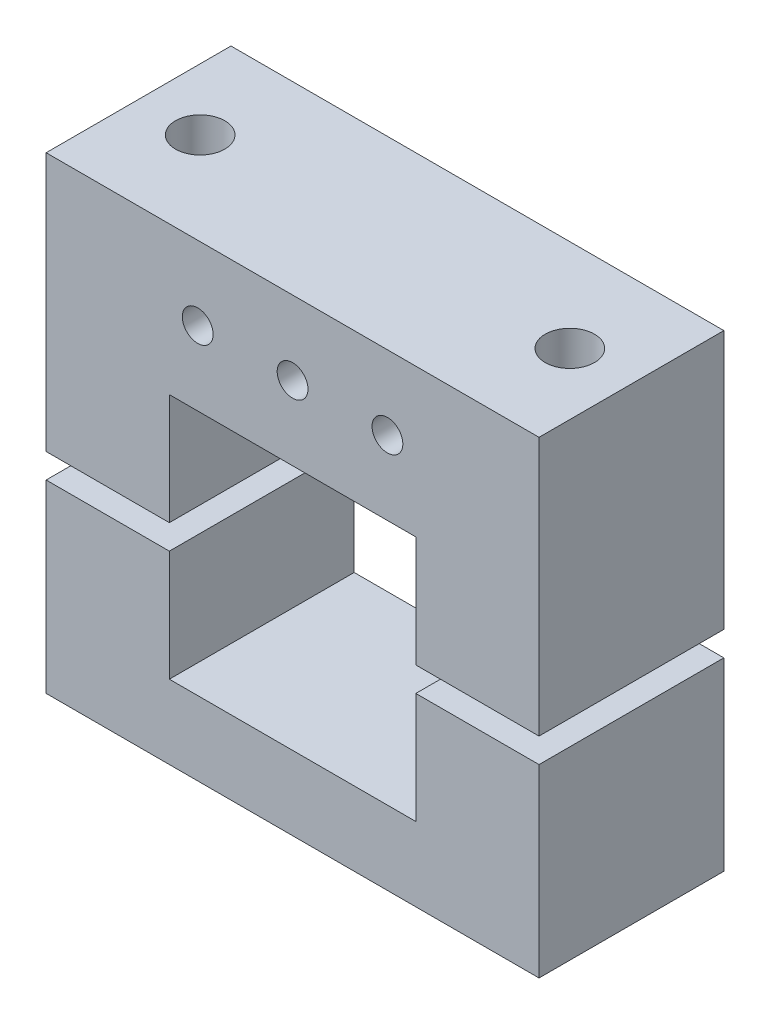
ISO-10303-21;
HEADER;
FILE_DESCRIPTION(('STEP AP214'),'2;1');
FILE_NAME('part.step','',(''),(''),'','','');
FILE_SCHEMA(('AUTOMOTIVE_DESIGN { 1 0 10303 214 1 1 1 1 }'));
ENDSEC;
DATA;
#1=APPLICATION_CONTEXT('core data for automotive mechanical design processes');
#2=APPLICATION_PROTOCOL_DEFINITION('international standard','automotive_design',2000,#1);
#3=PRODUCT_CONTEXT('',#1,'mechanical');
#4=PRODUCT('Part','Part','',(#3));
#5=PRODUCT_RELATED_PRODUCT_CATEGORY('part','',(#4));
#6=PRODUCT_DEFINITION_FORMATION('','',#4);
#7=PRODUCT_DEFINITION_CONTEXT('part definition',#1,'design');
#8=PRODUCT_DEFINITION('design','',#6,#7);
#9=PRODUCT_DEFINITION_SHAPE('','',#8);
#10=(LENGTH_UNIT() NAMED_UNIT(*) SI_UNIT(.MILLI.,.METRE.));
#11=(NAMED_UNIT(*) PLANE_ANGLE_UNIT() SI_UNIT($,.RADIAN.));
#12=(NAMED_UNIT(*) SI_UNIT($,.STERADIAN.) SOLID_ANGLE_UNIT());
#13=UNCERTAINTY_MEASURE_WITH_UNIT(LENGTH_MEASURE(1.E-05),#10,'distance_accuracy_value','');
#14=(GEOMETRIC_REPRESENTATION_CONTEXT(3) GLOBAL_UNCERTAINTY_ASSIGNED_CONTEXT((#13)) GLOBAL_UNIT_ASSIGNED_CONTEXT((#10,
#11,#12)) REPRESENTATION_CONTEXT('',''));
#15=CARTESIAN_POINT('',(0.,0.,0.));
#16=DIRECTION('',(0.,0.,1.));
#17=DIRECTION('',(1.,0.,0.));
#18=AXIS2_PLACEMENT_3D('',#15,#16,#17);
#19=CARTESIAN_POINT('',(-382.389529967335,0.294684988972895,15.));
#20=DIRECTION('',(1.,0.,0.));
#21=DIRECTION('',(0.,0.,-1.));
#22=AXIS2_PLACEMENT_3D('',#19,#20,#21);
#23=PLANE('',#22);
#24=DIRECTION('',(0.,-1.,0.));
#25=VECTOR('',#24,1.);
#26=CARTESIAN_POINT('',(-382.389529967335,0.294684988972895,0.));
#27=LINE('',#26,#25);
#28=CARTESIAN_POINT('',(-382.389529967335,0.294684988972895,0.));
#29=VERTEX_POINT('',#28);
#30=CARTESIAN_POINT('',(-382.389529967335,-8.70531501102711,0.));
#31=VERTEX_POINT('',#30);
#32=EDGE_CURVE('E140',#29,#31,#27,.T.);
#33=ORIENTED_EDGE('',*,*,#32,.T.);
#34=DIRECTION('',(0.,0.,-1.));
#35=VECTOR('',#34,1.);
#36=CARTESIAN_POINT('',(-382.389529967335,-8.70531501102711,15.));
#37=LINE('',#36,#35);
#38=CARTESIAN_POINT('',(-382.389529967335,-8.70531501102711,15.));
#39=VERTEX_POINT('',#38);
#40=EDGE_CURVE('E12',#39,#31,#37,.T.);
#41=ORIENTED_EDGE('',*,*,#40,.F.);
#42=DIRECTION('',(0.,-1.,0.));
#43=VECTOR('',#42,1.);
#44=CARTESIAN_POINT('',(-382.389529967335,0.294684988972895,15.));
#45=LINE('',#44,#43);
#46=CARTESIAN_POINT('',(-382.389529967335,0.294684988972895,15.));
#47=VERTEX_POINT('',#46);
#48=EDGE_CURVE('E155',#47,#39,#45,.T.);
#49=ORIENTED_EDGE('',*,*,#48,.F.);
#50=DIRECTION('',(0.,0.,-1.));
#51=VECTOR('',#50,1.);
#52=CARTESIAN_POINT('',(-382.389529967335,0.294684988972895,15.));
#53=LINE('',#52,#51);
#54=EDGE_CURVE('E136',#47,#29,#53,.T.);
#55=ORIENTED_EDGE('',*,*,#54,.T.);
#56=EDGE_LOOP('',(#33,#41,#49,#55));
#57=FACE_BOUND('',#56,.T.);
#58=ADVANCED_FACE('F42',(#57),#23,.F.);
#59=CARTESIAN_POINT('',(-382.389529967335,-8.70531501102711,15.));
#60=DIRECTION('',(0.,-1.,0.));
#61=DIRECTION('',(0.,0.,-1.));
#62=AXIS2_PLACEMENT_3D('',#59,#60,#61);
#63=PLANE('',#62);
#64=DIRECTION('',(-1.,0.,0.));
#65=VECTOR('',#64,1.);
#66=CARTESIAN_POINT('',(-382.389529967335,-8.70531501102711,0.));
#67=LINE('',#66,#65);
#68=CARTESIAN_POINT('',(-402.389529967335,-8.70531501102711,0.));
#69=VERTEX_POINT('',#68);
#70=EDGE_CURVE('E143',#31,#69,#67,.T.);
#71=ORIENTED_EDGE('',*,*,#70,.T.);
#72=DIRECTION('',(0.,0.,-1.));
#73=VECTOR('',#72,1.);
#74=CARTESIAN_POINT('',(-402.389529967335,-8.70531501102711,15.));
#75=LINE('',#74,#73);
#76=CARTESIAN_POINT('',(-402.389529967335,-8.70531501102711,15.));
#77=VERTEX_POINT('',#76);
#78=EDGE_CURVE('E51',#77,#69,#75,.T.);
#79=ORIENTED_EDGE('',*,*,#78,.F.);
#80=DIRECTION('',(-1.,0.,0.));
#81=VECTOR('',#80,1.);
#82=CARTESIAN_POINT('',(-382.389529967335,-8.70531501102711,15.));
#83=LINE('',#82,#81);
#84=EDGE_CURVE('E103',#39,#77,#83,.T.);
#85=ORIENTED_EDGE('',*,*,#84,.F.);
#86=ORIENTED_EDGE('',*,*,#40,.T.);
#87=EDGE_LOOP('',(#71,#79,#85,#86));
#88=FACE_BOUND('',#87,.T.);
#89=ADVANCED_FACE('F212',(#88),#63,.F.);
#90=CARTESIAN_POINT('',(-402.389529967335,0.294684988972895,15.));
#91=DIRECTION('',(-1.,0.,0.));
#92=DIRECTION('',(0.,0.,1.));
#93=AXIS2_PLACEMENT_3D('',#90,#91,#92);
#94=PLANE('',#93);
#95=DIRECTION('',(0.,1.,0.));
#96=VECTOR('',#95,1.);
#97=CARTESIAN_POINT('',(-402.389529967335,0.294684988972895,0.));
#98=LINE('',#97,#96);
#99=CARTESIAN_POINT('',(-402.389529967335,0.294684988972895,0.));
#100=VERTEX_POINT('',#99);
#101=EDGE_CURVE('E146',#69,#100,#98,.T.);
#102=ORIENTED_EDGE('',*,*,#101,.T.);
#103=DIRECTION('',(0.,0.,-1.));
#104=VECTOR('',#103,1.);
#105=CARTESIAN_POINT('',(-402.389529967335,0.294684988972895,15.));
#106=LINE('',#105,#104);
#107=CARTESIAN_POINT('',(-402.389529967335,0.294684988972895,15.));
#108=VERTEX_POINT('',#107);
#109=EDGE_CURVE('E162',#108,#100,#106,.T.);
#110=ORIENTED_EDGE('',*,*,#109,.F.);
#111=DIRECTION('',(0.,1.,0.));
#112=VECTOR('',#111,1.);
#113=CARTESIAN_POINT('',(-402.389529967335,0.294684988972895,15.));
#114=LINE('',#113,#112);
#115=EDGE_CURVE('E181',#77,#108,#114,.T.);
#116=ORIENTED_EDGE('',*,*,#115,.F.);
#117=ORIENTED_EDGE('',*,*,#78,.T.);
#118=EDGE_LOOP('',(#102,#110,#116,#117));
#119=FACE_BOUND('',#118,.T.);
#120=ADVANCED_FACE('F216',(#119),#94,.F.);
#121=CARTESIAN_POINT('',(-402.389529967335,0.294684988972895,15.));
#122=DIRECTION('',(0.,-1.,0.));
#123=DIRECTION('',(0.,0.,-1.));
#124=AXIS2_PLACEMENT_3D('',#121,#122,#123);
#125=PLANE('',#124);
#126=CARTESIAN_POINT('',(-407.389529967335,0.294684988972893,7.5));
#127=DIRECTION('',(0.,-1.,0.));
#128=DIRECTION('',(0.,0.,-1.));
#129=AXIS2_PLACEMENT_3D('',#126,#127,#128);
#130=CIRCLE('',#129,2.);
#131=CARTESIAN_POINT('',(-407.389529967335,0.294684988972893,5.5));
#132=VERTEX_POINT('',#131);
#133=EDGE_CURVE('E144',#132,#132,#130,.T.);
#134=ORIENTED_EDGE('',*,*,#133,.T.);
#135=EDGE_LOOP('',(#134));
#136=FACE_BOUND('',#135,.T.);
#137=DIRECTION('',(-1.,0.,0.));
#138=VECTOR('',#137,1.);
#139=CARTESIAN_POINT('',(-402.389529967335,0.294684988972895,0.));
#140=LINE('',#139,#138);
#141=CARTESIAN_POINT('',(-412.389529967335,0.294684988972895,0.));
#142=VERTEX_POINT('',#141);
#143=EDGE_CURVE('E148',#100,#142,#140,.T.);
#144=ORIENTED_EDGE('',*,*,#143,.T.);
#145=DIRECTION('',(0.,0.,-1.));
#146=VECTOR('',#145,1.);
#147=CARTESIAN_POINT('',(-412.389529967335,0.294684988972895,15.));
#148=LINE('',#147,#146);
#149=CARTESIAN_POINT('',(-412.389529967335,0.294684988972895,15.));
#150=VERTEX_POINT('',#149);
#151=EDGE_CURVE('E159',#150,#142,#148,.T.);
#152=ORIENTED_EDGE('',*,*,#151,.F.);
#153=DIRECTION('',(-1.,0.,0.));
#154=VECTOR('',#153,1.);
#155=CARTESIAN_POINT('',(-402.389529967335,0.294684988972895,15.));
#156=LINE('',#155,#154);
#157=EDGE_CURVE('E183',#108,#150,#156,.T.);
#158=ORIENTED_EDGE('',*,*,#157,.F.);
#159=ORIENTED_EDGE('',*,*,#109,.T.);
#160=EDGE_LOOP('',(#144,#152,#158,#159));
#161=FACE_BOUND('',#160,.T.);
#162=ADVANCED_FACE('F189',(#136,#161),#125,.F.);
#163=CARTESIAN_POINT('',(-412.389529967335,-14.7053150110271,15.));
#164=DIRECTION('',(1.,0.,0.));
#165=DIRECTION('',(0.,0.,-1.));
#166=AXIS2_PLACEMENT_3D('',#163,#164,#165);
#167=PLANE('',#166);
#168=DIRECTION('',(0.,-1.,0.));
#169=VECTOR('',#168,1.);
#170=CARTESIAN_POINT('',(-412.389529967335,-14.7053150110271,0.));
#171=LINE('',#170,#169);
#172=CARTESIAN_POINT('',(-412.389529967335,-14.7053150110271,0.));
#173=VERTEX_POINT('',#172);
#174=EDGE_CURVE('E150',#142,#173,#171,.T.);
#175=ORIENTED_EDGE('',*,*,#174,.T.);
#176=DIRECTION('',(0.,0.,-1.));
#177=VECTOR('',#176,1.);
#178=CARTESIAN_POINT('',(-412.389529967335,-14.7053150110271,15.));
#179=LINE('',#178,#177);
#180=CARTESIAN_POINT('',(-412.389529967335,-14.7053150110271,15.));
#181=VERTEX_POINT('',#180);
#182=EDGE_CURVE('E131',#181,#173,#179,.T.);
#183=ORIENTED_EDGE('',*,*,#182,.F.);
#184=DIRECTION('',(0.,-1.,0.));
#185=VECTOR('',#184,1.);
#186=CARTESIAN_POINT('',(-412.389529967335,-14.7053150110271,15.));
#187=LINE('',#186,#185);
#188=EDGE_CURVE('E122',#150,#181,#187,.T.);
#189=ORIENTED_EDGE('',*,*,#188,.F.);
#190=ORIENTED_EDGE('',*,*,#151,.T.);
#191=EDGE_LOOP('',(#175,#183,#189,#190));
#192=FACE_BOUND('',#191,.T.);
#193=ADVANCED_FACE('F193',(#192),#167,.F.);
#194=CARTESIAN_POINT('',(-412.389529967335,-14.7053150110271,15.));
#195=DIRECTION('',(0.,1.,0.));
#196=DIRECTION('',(0.,0.,1.));
#197=AXIS2_PLACEMENT_3D('',#194,#195,#196);
#198=PLANE('',#197);
#199=CARTESIAN_POINT('',(-407.389529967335,-14.7053150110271,7.5));
#200=DIRECTION('',(0.,1.,0.));
#201=DIRECTION('',(0.,0.,1.));
#202=AXIS2_PLACEMENT_3D('',#199,#200,#201);
#203=CIRCLE('',#202,2.);
#204=CARTESIAN_POINT('',(-407.389529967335,-14.7053150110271,9.49999999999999));
#205=VERTEX_POINT('',#204);
#206=EDGE_CURVE('E45',#205,#205,#203,.T.);
#207=ORIENTED_EDGE('',*,*,#206,.T.);
#208=EDGE_LOOP('',(#207));
#209=FACE_BOUND('',#208,.T.);
#210=CARTESIAN_POINT('',(-377.389529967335,-14.7053150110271,7.5));
#211=DIRECTION('',(0.,1.,0.));
#212=DIRECTION('',(0.,0.,1.));
#213=AXIS2_PLACEMENT_3D('',#210,#211,#212);
#214=CIRCLE('',#213,2.);
#215=CARTESIAN_POINT('',(-377.389529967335,-14.7053150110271,9.49999999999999));
#216=VERTEX_POINT('',#215);
#217=EDGE_CURVE('E168',#216,#216,#214,.T.);
#218=ORIENTED_EDGE('',*,*,#217,.T.);
#219=EDGE_LOOP('',(#218));
#220=FACE_BOUND('',#219,.T.);
#221=DIRECTION('',(1.,0.,0.));
#222=VECTOR('',#221,1.);
#223=CARTESIAN_POINT('',(-412.389529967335,-14.7053150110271,0.));
#224=LINE('',#223,#222);
#225=CARTESIAN_POINT('',(-372.389529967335,-14.7053150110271,0.));
#226=VERTEX_POINT('',#225);
#227=EDGE_CURVE('E130',#173,#226,#224,.T.);
#228=ORIENTED_EDGE('',*,*,#227,.T.);
#229=DIRECTION('',(0.,0.,-1.));
#230=VECTOR('',#229,1.);
#231=CARTESIAN_POINT('',(-372.389529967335,-14.7053150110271,15.));
#232=LINE('',#231,#230);
#233=CARTESIAN_POINT('',(-372.389529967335,-14.7053150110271,15.));
#234=VERTEX_POINT('',#233);
#235=EDGE_CURVE('E127',#234,#226,#232,.T.);
#236=ORIENTED_EDGE('',*,*,#235,.F.);
#237=DIRECTION('',(1.,0.,0.));
#238=VECTOR('',#237,1.);
#239=CARTESIAN_POINT('',(-412.389529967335,-14.7053150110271,15.));
#240=LINE('',#239,#238);
#241=EDGE_CURVE('E116',#181,#234,#240,.T.);
#242=ORIENTED_EDGE('',*,*,#241,.F.);
#243=ORIENTED_EDGE('',*,*,#182,.T.);
#244=EDGE_LOOP('',(#228,#236,#242,#243));
#245=FACE_BOUND('',#244,.T.);
#246=ADVANCED_FACE('F128',(#209,#220,#245),#198,.F.);
#247=CARTESIAN_POINT('',(-372.389529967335,-14.7053150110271,15.));
#248=DIRECTION('',(-1.,0.,0.));
#249=DIRECTION('',(0.,0.,1.));
#250=AXIS2_PLACEMENT_3D('',#247,#248,#249);
#251=PLANE('',#250);
#252=DIRECTION('',(0.,1.,0.));
#253=VECTOR('',#252,1.);
#254=CARTESIAN_POINT('',(-372.389529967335,-14.7053150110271,0.));
#255=LINE('',#254,#253);
#256=CARTESIAN_POINT('',(-372.389529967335,0.294684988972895,0.));
#257=VERTEX_POINT('',#256);
#258=EDGE_CURVE('E89',#226,#257,#255,.T.);
#259=ORIENTED_EDGE('',*,*,#258,.T.);
#260=DIRECTION('',(0.,0.,-1.));
#261=VECTOR('',#260,1.);
#262=CARTESIAN_POINT('',(-372.389529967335,0.294684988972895,15.));
#263=LINE('',#262,#261);
#264=CARTESIAN_POINT('',(-372.389529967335,0.294684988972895,15.));
#265=VERTEX_POINT('',#264);
#266=EDGE_CURVE('E132',#265,#257,#263,.T.);
#267=ORIENTED_EDGE('',*,*,#266,.F.);
#268=DIRECTION('',(0.,1.,0.));
#269=VECTOR('',#268,1.);
#270=CARTESIAN_POINT('',(-372.389529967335,-14.7053150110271,15.));
#271=LINE('',#270,#269);
#272=EDGE_CURVE('E120',#234,#265,#271,.T.);
#273=ORIENTED_EDGE('',*,*,#272,.F.);
#274=ORIENTED_EDGE('',*,*,#235,.T.);
#275=EDGE_LOOP('',(#259,#267,#273,#274));
#276=FACE_BOUND('',#275,.T.);
#277=ADVANCED_FACE('F134',(#276),#251,.F.);
#278=CARTESIAN_POINT('',(-382.389529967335,0.294684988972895,15.));
#279=DIRECTION('',(0.,-1.,0.));
#280=DIRECTION('',(0.,0.,-1.));
#281=AXIS2_PLACEMENT_3D('',#278,#279,#280);
#282=PLANE('',#281);
#283=CARTESIAN_POINT('',(-377.389529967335,0.294684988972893,7.5));
#284=DIRECTION('',(0.,-1.,0.));
#285=DIRECTION('',(0.,0.,-1.));
#286=AXIS2_PLACEMENT_3D('',#283,#284,#285);
#287=CIRCLE('',#286,2.);
#288=CARTESIAN_POINT('',(-377.389529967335,0.294684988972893,5.5));
#289=VERTEX_POINT('',#288);
#290=EDGE_CURVE('E166',#289,#289,#287,.T.);
#291=ORIENTED_EDGE('',*,*,#290,.T.);
#292=EDGE_LOOP('',(#291));
#293=FACE_BOUND('',#292,.T.);
#294=DIRECTION('',(-1.,0.,0.));
#295=VECTOR('',#294,1.);
#296=CARTESIAN_POINT('',(-382.389529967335,0.294684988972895,0.));
#297=LINE('',#296,#295);
#298=EDGE_CURVE('E95',#257,#29,#297,.T.);
#299=ORIENTED_EDGE('',*,*,#298,.T.);
#300=ORIENTED_EDGE('',*,*,#54,.F.);
#301=DIRECTION('',(-1.,0.,0.));
#302=VECTOR('',#301,1.);
#303=CARTESIAN_POINT('',(-382.389529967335,0.294684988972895,15.));
#304=LINE('',#303,#302);
#305=EDGE_CURVE('E60',#265,#47,#304,.T.);
#306=ORIENTED_EDGE('',*,*,#305,.F.);
#307=ORIENTED_EDGE('',*,*,#266,.T.);
#308=EDGE_LOOP('',(#299,#300,#306,#307));
#309=FACE_BOUND('',#308,.T.);
#310=ADVANCED_FACE('F201',(#293,#309),#282,.F.);
#311=CARTESIAN_POINT('',(-382.389529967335,-8.70531501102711,15.));
#312=DIRECTION('',(0.,0.,-1.));
#313=DIRECTION('',(-1.,0.,0.));
#314=AXIS2_PLACEMENT_3D('',#311,#312,#313);
#315=PLANE('',#314);
#316=ORIENTED_EDGE('',*,*,#48,.T.);
#317=ORIENTED_EDGE('',*,*,#84,.T.);
#318=ORIENTED_EDGE('',*,*,#115,.T.);
#319=ORIENTED_EDGE('',*,*,#157,.T.);
#320=ORIENTED_EDGE('',*,*,#188,.T.);
#321=ORIENTED_EDGE('',*,*,#241,.T.);
#322=ORIENTED_EDGE('',*,*,#272,.T.);
#323=ORIENTED_EDGE('',*,*,#305,.T.);
#324=EDGE_LOOP('',(#316,#317,#318,#319,#320,#321,#322,#323));
#325=FACE_BOUND('',#324,.T.);
#326=ADVANCED_FACE('F118',(#325),#315,.F.);
#327=CARTESIAN_POINT('',(-382.389529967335,-8.70531501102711,0.));
#328=DIRECTION('',(0.,0.,-1.));
#329=DIRECTION('',(-1.,0.,0.));
#330=AXIS2_PLACEMENT_3D('',#327,#328,#329);
#331=PLANE('',#330);
#332=ORIENTED_EDGE('',*,*,#32,.F.);
#333=ORIENTED_EDGE('',*,*,#298,.F.);
#334=ORIENTED_EDGE('',*,*,#258,.F.);
#335=ORIENTED_EDGE('',*,*,#227,.F.);
#336=ORIENTED_EDGE('',*,*,#174,.F.);
#337=ORIENTED_EDGE('',*,*,#143,.F.);
#338=ORIENTED_EDGE('',*,*,#101,.F.);
#339=ORIENTED_EDGE('',*,*,#70,.F.);
#340=EDGE_LOOP('',(#332,#333,#334,#335,#336,#337,#338,#339));
#341=FACE_BOUND('',#340,.T.);
#342=ADVANCED_FACE('F196',(#341),#331,.T.);
#343=CARTESIAN_POINT('',(-377.389529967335,-42.7053150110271,7.5));
#344=DIRECTION('',(0.,1.,0.));
#345=DIRECTION('',(0.,0.,1.));
#346=AXIS2_PLACEMENT_3D('',#343,#344,#345);
#347=CYLINDRICAL_SURFACE('',#346,2.);
#348=ORIENTED_EDGE('',*,*,#290,.F.);
#349=EDGE_LOOP('',(#348));
#350=FACE_BOUND('',#349,.T.);
#351=ORIENTED_EDGE('',*,*,#217,.F.);
#352=EDGE_LOOP('',(#351));
#353=FACE_BOUND('',#352,.T.);
#354=ADVANCED_FACE('F237',(#350,#353),#347,.F.);
#355=CARTESIAN_POINT('',(-407.389529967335,-42.7053150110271,7.5));
#356=DIRECTION('',(0.,1.,0.));
#357=DIRECTION('',(0.,0.,1.));
#358=AXIS2_PLACEMENT_3D('',#355,#356,#357);
#359=CYLINDRICAL_SURFACE('',#358,2.);
#360=ORIENTED_EDGE('',*,*,#206,.F.);
#361=EDGE_LOOP('',(#360));
#362=FACE_BOUND('',#361,.T.);
#363=ORIENTED_EDGE('',*,*,#133,.F.);
#364=EDGE_LOOP('',(#363));
#365=FACE_BOUND('',#364,.T.);
#366=ADVANCED_FACE('F234',(#362,#365),#359,.F.);
#367=CLOSED_SHELL('',(#58,#89,#120,#162,#193,#246,#277,#310,#326,#342,#354,#366));
#368=MANIFOLD_SOLID_BREP('B2',#367);
#369=CARTESIAN_POINT('',(-402.389529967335,2.29468498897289,15.));
#370=DIRECTION('',(0.,0.,-1.));
#371=DIRECTION('',(-1.,0.,0.));
#372=AXIS2_PLACEMENT_3D('',#369,#370,#371);
#373=PLANE('',#372);
#374=CARTESIAN_POINT('',(-392.389529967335,17.2946849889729,15.));
#375=DIRECTION('',(0.,0.,1.));
#376=DIRECTION('',(1.,0.,0.));
#377=AXIS2_PLACEMENT_3D('',#374,#375,#376);
#378=CIRCLE('',#377,1.24999999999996);
#379=CARTESIAN_POINT('',(-391.139529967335,17.2946849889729,15.));
#380=VERTEX_POINT('',#379);
#381=EDGE_CURVE('E462',#380,#380,#378,.T.);
#382=ORIENTED_EDGE('',*,*,#381,.F.);
#383=EDGE_LOOP('',(#382));
#384=FACE_BOUND('',#383,.T.);
#385=DIRECTION('',(0.,1.,0.));
#386=VECTOR('',#385,1.);
#387=CARTESIAN_POINT('',(-402.389529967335,11.2946849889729,15.));
#388=LINE('',#387,#386);
#389=CARTESIAN_POINT('',(-402.389529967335,2.29468498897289,15.));
#390=VERTEX_POINT('',#389);
#391=CARTESIAN_POINT('',(-402.389529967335,11.2946849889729,15.));
#392=VERTEX_POINT('',#391);
#393=EDGE_CURVE('E424',#390,#392,#388,.T.);
#394=ORIENTED_EDGE('',*,*,#393,.T.);
#395=DIRECTION('',(1.,0.,0.));
#396=VECTOR('',#395,1.);
#397=CARTESIAN_POINT('',(-402.389529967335,11.2946849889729,15.));
#398=LINE('',#397,#396);
#399=CARTESIAN_POINT('',(-382.389529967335,11.2946849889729,15.));
#400=VERTEX_POINT('',#399);
#401=EDGE_CURVE('E372',#392,#400,#398,.T.);
#402=ORIENTED_EDGE('',*,*,#401,.T.);
#403=DIRECTION('',(0.,-1.,0.));
#404=VECTOR('',#403,1.);
#405=CARTESIAN_POINT('',(-382.389529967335,11.2946849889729,15.));
#406=LINE('',#405,#404);
#407=CARTESIAN_POINT('',(-382.389529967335,2.29468498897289,15.));
#408=VERTEX_POINT('',#407);
#409=EDGE_CURVE('E440',#400,#408,#406,.T.);
#410=ORIENTED_EDGE('',*,*,#409,.T.);
#411=DIRECTION('',(1.,0.,0.));
#412=VECTOR('',#411,1.);
#413=CARTESIAN_POINT('',(-382.389529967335,2.29468498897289,15.));
#414=LINE('',#413,#412);
#415=CARTESIAN_POINT('',(-372.389529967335,2.29468498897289,15.));
#416=VERTEX_POINT('',#415);
#417=EDGE_CURVE('E453',#408,#416,#414,.T.);
#418=ORIENTED_EDGE('',*,*,#417,.T.);
#419=DIRECTION('',(0.,1.,0.));
#420=VECTOR('',#419,1.);
#421=CARTESIAN_POINT('',(-372.389529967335,23.2946849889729,15.));
#422=LINE('',#421,#420);
#423=CARTESIAN_POINT('',(-372.389529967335,23.2946849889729,15.));
#424=VERTEX_POINT('',#423);
#425=EDGE_CURVE('E391',#416,#424,#422,.T.);
#426=ORIENTED_EDGE('',*,*,#425,.T.);
#427=DIRECTION('',(-1.,0.,0.));
#428=VECTOR('',#427,1.);
#429=CARTESIAN_POINT('',(-392.389529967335,23.2946849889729,15.));
#430=LINE('',#429,#428);
#431=CARTESIAN_POINT('',(-412.389529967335,23.2946849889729,15.));
#432=VERTEX_POINT('',#431);
#433=EDGE_CURVE('E385',#424,#432,#430,.T.);
#434=ORIENTED_EDGE('',*,*,#433,.T.);
#435=DIRECTION('',(0.,-1.,0.));
#436=VECTOR('',#435,1.);
#437=CARTESIAN_POINT('',(-412.389529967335,23.2946849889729,15.));
#438=LINE('',#437,#436);
#439=CARTESIAN_POINT('',(-412.389529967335,2.29468498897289,15.));
#440=VERTEX_POINT('',#439);
#441=EDGE_CURVE('E389',#432,#440,#438,.T.);
#442=ORIENTED_EDGE('',*,*,#441,.T.);
#443=DIRECTION('',(1.,0.,0.));
#444=VECTOR('',#443,1.);
#445=CARTESIAN_POINT('',(-402.389529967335,2.29468498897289,15.));
#446=LINE('',#445,#444);
#447=EDGE_CURVE('E329',#440,#390,#446,.T.);
#448=ORIENTED_EDGE('',*,*,#447,.T.);
#449=EDGE_LOOP('',(#394,#402,#410,#418,#426,#434,#442,#448));
#450=FACE_BOUND('',#449,.T.);
#451=CARTESIAN_POINT('',(-384.691589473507,17.2946849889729,15.));
#452=DIRECTION('',(0.,0.,1.));
#453=DIRECTION('',(1.,0.,0.));
#454=AXIS2_PLACEMENT_3D('',#451,#452,#453);
#455=CIRCLE('',#454,1.24999999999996);
#456=CARTESIAN_POINT('',(-383.441589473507,17.2946849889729,15.));
#457=VERTEX_POINT('',#456);
#458=EDGE_CURVE('E412',#457,#457,#455,.T.);
#459=ORIENTED_EDGE('',*,*,#458,.F.);
#460=EDGE_LOOP('',(#459));
#461=FACE_BOUND('',#460,.T.);
#462=CARTESIAN_POINT('',(-400.087470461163,17.2946849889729,15.));
#463=DIRECTION('',(0.,0.,1.));
#464=DIRECTION('',(-1.,0.,0.));
#465=AXIS2_PLACEMENT_3D('',#462,#463,#464);
#466=CIRCLE('',#465,1.24999999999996);
#467=CARTESIAN_POINT('',(-401.337470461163,17.2946849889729,15.));
#468=VERTEX_POINT('',#467);
#469=EDGE_CURVE('E468',#468,#468,#466,.T.);
#470=ORIENTED_EDGE('',*,*,#469,.F.);
#471=EDGE_LOOP('',(#470));
#472=FACE_BOUND('',#471,.T.);
#473=ADVANCED_FACE('F311',(#384,#450,#461,#472),#373,.F.);
#474=CARTESIAN_POINT('',(-402.389529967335,2.29468498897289,0.));
#475=DIRECTION('',(0.,0.,-1.));
#476=DIRECTION('',(-1.,0.,0.));
#477=AXIS2_PLACEMENT_3D('',#474,#475,#476);
#478=PLANE('',#477);
#479=CARTESIAN_POINT('',(-392.389529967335,17.2946849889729,0.));
#480=DIRECTION('',(0.,0.,1.));
#481=DIRECTION('',(1.,0.,0.));
#482=AXIS2_PLACEMENT_3D('',#479,#480,#481);
#483=CIRCLE('',#482,1.24999999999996);
#484=CARTESIAN_POINT('',(-391.139529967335,17.2946849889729,0.));
#485=VERTEX_POINT('',#484);
#486=EDGE_CURVE('E465',#485,#485,#483,.T.);
#487=ORIENTED_EDGE('',*,*,#486,.T.);
#488=EDGE_LOOP('',(#487));
#489=FACE_BOUND('',#488,.T.);
#490=DIRECTION('',(0.,1.,0.));
#491=VECTOR('',#490,1.);
#492=CARTESIAN_POINT('',(-402.389529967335,11.2946849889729,0.));
#493=LINE('',#492,#491);
#494=CARTESIAN_POINT('',(-402.389529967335,2.29468498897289,0.));
#495=VERTEX_POINT('',#494);
#496=CARTESIAN_POINT('',(-402.389529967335,11.2946849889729,0.));
#497=VERTEX_POINT('',#496);
#498=EDGE_CURVE('E408',#495,#497,#493,.T.);
#499=ORIENTED_EDGE('',*,*,#498,.F.);
#500=DIRECTION('',(1.,0.,0.));
#501=VECTOR('',#500,1.);
#502=CARTESIAN_POINT('',(-402.389529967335,2.29468498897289,0.));
#503=LINE('',#502,#501);
#504=CARTESIAN_POINT('',(-412.389529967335,2.29468498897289,0.));
#505=VERTEX_POINT('',#504);
#506=EDGE_CURVE('E364',#505,#495,#503,.T.);
#507=ORIENTED_EDGE('',*,*,#506,.F.);
#508=DIRECTION('',(0.,-1.,0.));
#509=VECTOR('',#508,1.);
#510=CARTESIAN_POINT('',(-412.389529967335,23.2946849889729,0.));
#511=LINE('',#510,#509);
#512=CARTESIAN_POINT('',(-412.389529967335,23.2946849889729,0.));
#513=VERTEX_POINT('',#512);
#514=EDGE_CURVE('E358',#513,#505,#511,.T.);
#515=ORIENTED_EDGE('',*,*,#514,.F.);
#516=DIRECTION('',(-1.,0.,0.));
#517=VECTOR('',#516,1.);
#518=CARTESIAN_POINT('',(-392.389529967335,23.2946849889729,0.));
#519=LINE('',#518,#517);
#520=CARTESIAN_POINT('',(-372.389529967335,23.2946849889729,0.));
#521=VERTEX_POINT('',#520);
#522=EDGE_CURVE('E398',#521,#513,#519,.T.);
#523=ORIENTED_EDGE('',*,*,#522,.F.);
#524=DIRECTION('',(0.,1.,0.));
#525=VECTOR('',#524,1.);
#526=CARTESIAN_POINT('',(-372.389529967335,23.2946849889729,0.));
#527=LINE('',#526,#525);
#528=CARTESIAN_POINT('',(-372.389529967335,2.29468498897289,0.));
#529=VERTEX_POINT('',#528);
#530=EDGE_CURVE('E418',#529,#521,#527,.T.);
#531=ORIENTED_EDGE('',*,*,#530,.F.);
#532=DIRECTION('',(1.,0.,0.));
#533=VECTOR('',#532,1.);
#534=CARTESIAN_POINT('',(-382.389529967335,2.29468498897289,0.));
#535=LINE('',#534,#533);
#536=CARTESIAN_POINT('',(-382.389529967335,2.29468498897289,0.));
#537=VERTEX_POINT('',#536);
#538=EDGE_CURVE('E416',#537,#529,#535,.T.);
#539=ORIENTED_EDGE('',*,*,#538,.F.);
#540=DIRECTION('',(0.,-1.,0.));
#541=VECTOR('',#540,1.);
#542=CARTESIAN_POINT('',(-382.389529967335,11.2946849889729,0.));
#543=LINE('',#542,#541);
#544=CARTESIAN_POINT('',(-382.389529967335,11.2946849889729,0.));
#545=VERTEX_POINT('',#544);
#546=EDGE_CURVE('E414',#545,#537,#543,.T.);
#547=ORIENTED_EDGE('',*,*,#546,.F.);
#548=DIRECTION('',(1.,0.,0.));
#549=VECTOR('',#548,1.);
#550=CARTESIAN_POINT('',(-402.389529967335,11.2946849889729,0.));
#551=LINE('',#550,#549);
#552=EDGE_CURVE('E411',#497,#545,#551,.T.);
#553=ORIENTED_EDGE('',*,*,#552,.F.);
#554=EDGE_LOOP('',(#499,#507,#515,#523,#531,#539,#547,#553));
#555=FACE_BOUND('',#554,.T.);
#556=CARTESIAN_POINT('',(-384.691589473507,17.2946849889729,0.));
#557=DIRECTION('',(0.,0.,1.));
#558=DIRECTION('',(1.,0.,0.));
#559=AXIS2_PLACEMENT_3D('',#556,#557,#558);
#560=CIRCLE('',#559,1.24999999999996);
#561=CARTESIAN_POINT('',(-383.441589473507,17.2946849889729,0.));
#562=VERTEX_POINT('',#561);
#563=EDGE_CURVE('E459',#562,#562,#560,.T.);
#564=ORIENTED_EDGE('',*,*,#563,.T.);
#565=EDGE_LOOP('',(#564));
#566=FACE_BOUND('',#565,.T.);
#567=CARTESIAN_POINT('',(-400.087470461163,17.2946849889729,0.));
#568=DIRECTION('',(0.,0.,1.));
#569=DIRECTION('',(-1.,0.,0.));
#570=AXIS2_PLACEMENT_3D('',#567,#568,#569);
#571=CIRCLE('',#570,1.24999999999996);
#572=CARTESIAN_POINT('',(-401.337470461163,17.2946849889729,0.));
#573=VERTEX_POINT('',#572);
#574=EDGE_CURVE('E471',#573,#573,#571,.T.);
#575=ORIENTED_EDGE('',*,*,#574,.T.);
#576=EDGE_LOOP('',(#575));
#577=FACE_BOUND('',#576,.T.);
#578=ADVANCED_FACE('F444',(#489,#555,#566,#577),#478,.T.);
#579=CARTESIAN_POINT('',(-402.389529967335,11.2946849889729,15.));
#580=DIRECTION('',(-1.,0.,0.));
#581=DIRECTION('',(0.,0.,1.));
#582=AXIS2_PLACEMENT_3D('',#579,#580,#581);
#583=PLANE('',#582);
#584=ORIENTED_EDGE('',*,*,#498,.T.);
#585=DIRECTION('',(0.,0.,-1.));
#586=VECTOR('',#585,1.);
#587=CARTESIAN_POINT('',(-402.389529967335,11.2946849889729,15.));
#588=LINE('',#587,#586);
#589=EDGE_CURVE('E40',#392,#497,#588,.T.);
#590=ORIENTED_EDGE('',*,*,#589,.F.);
#591=ORIENTED_EDGE('',*,*,#393,.F.);
#592=DIRECTION('',(0.,0.,-1.));
#593=VECTOR('',#592,1.);
#594=CARTESIAN_POINT('',(-402.389529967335,2.29468498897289,15.));
#595=LINE('',#594,#593);
#596=EDGE_CURVE('E404',#390,#495,#595,.T.);
#597=ORIENTED_EDGE('',*,*,#596,.T.);
#598=EDGE_LOOP('',(#584,#590,#591,#597));
#599=FACE_BOUND('',#598,.T.);
#600=ADVANCED_FACE('F313',(#599),#583,.F.);
#601=CARTESIAN_POINT('',(-402.389529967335,11.2946849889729,15.));
#602=DIRECTION('',(0.,1.,0.));
#603=DIRECTION('',(0.,0.,1.));
#604=AXIS2_PLACEMENT_3D('',#601,#602,#603);
#605=PLANE('',#604);
#606=ORIENTED_EDGE('',*,*,#552,.T.);
#607=DIRECTION('',(0.,0.,-1.));
#608=VECTOR('',#607,1.);
#609=CARTESIAN_POINT('',(-382.389529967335,11.2946849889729,15.));
#610=LINE('',#609,#608);
#611=EDGE_CURVE('E321',#400,#545,#610,.T.);
#612=ORIENTED_EDGE('',*,*,#611,.F.);
#613=ORIENTED_EDGE('',*,*,#401,.F.);
#614=ORIENTED_EDGE('',*,*,#589,.T.);
#615=EDGE_LOOP('',(#606,#612,#613,#614));
#616=FACE_BOUND('',#615,.T.);
#617=ADVANCED_FACE('F531',(#616),#605,.F.);
#618=CARTESIAN_POINT('',(-382.389529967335,11.2946849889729,15.));
#619=DIRECTION('',(1.,0.,0.));
#620=DIRECTION('',(0.,0.,-1.));
#621=AXIS2_PLACEMENT_3D('',#618,#619,#620);
#622=PLANE('',#621);
#623=ORIENTED_EDGE('',*,*,#546,.T.);
#624=DIRECTION('',(0.,0.,-1.));
#625=VECTOR('',#624,1.);
#626=CARTESIAN_POINT('',(-382.389529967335,2.29468498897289,15.));
#627=LINE('',#626,#625);
#628=EDGE_CURVE('E431',#408,#537,#627,.T.);
#629=ORIENTED_EDGE('',*,*,#628,.F.);
#630=ORIENTED_EDGE('',*,*,#409,.F.);
#631=ORIENTED_EDGE('',*,*,#611,.T.);
#632=EDGE_LOOP('',(#623,#629,#630,#631));
#633=FACE_BOUND('',#632,.T.);
#634=ADVANCED_FACE('F438',(#633),#622,.F.);
#635=CARTESIAN_POINT('',(-382.389529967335,2.29468498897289,15.));
#636=DIRECTION('',(0.,1.,0.));
#637=DIRECTION('',(0.,0.,1.));
#638=AXIS2_PLACEMENT_3D('',#635,#636,#637);
#639=PLANE('',#638);
#640=CARTESIAN_POINT('',(-377.389529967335,2.29468498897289,7.5));
#641=DIRECTION('',(0.,1.,0.));
#642=DIRECTION('',(0.,0.,1.));
#643=AXIS2_PLACEMENT_3D('',#640,#641,#642);
#644=CIRCLE('',#643,2.);
#645=CARTESIAN_POINT('',(-377.389529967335,2.29468498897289,9.49999999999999));
#646=VERTEX_POINT('',#645);
#647=EDGE_CURVE('E474',#646,#646,#644,.T.);
#648=ORIENTED_EDGE('',*,*,#647,.T.);
#649=EDGE_LOOP('',(#648));
#650=FACE_BOUND('',#649,.T.);
#651=ORIENTED_EDGE('',*,*,#538,.T.);
#652=DIRECTION('',(0.,0.,-1.));
#653=VECTOR('',#652,1.);
#654=CARTESIAN_POINT('',(-372.389529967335,2.29468498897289,15.));
#655=LINE('',#654,#653);
#656=EDGE_CURVE('E428',#416,#529,#655,.T.);
#657=ORIENTED_EDGE('',*,*,#656,.F.);
#658=ORIENTED_EDGE('',*,*,#417,.F.);
#659=ORIENTED_EDGE('',*,*,#628,.T.);
#660=EDGE_LOOP('',(#651,#657,#658,#659));
#661=FACE_BOUND('',#660,.T.);
#662=ADVANCED_FACE('F449',(#650,#661),#639,.F.);
#663=CARTESIAN_POINT('',(-372.389529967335,23.2946849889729,15.));
#664=DIRECTION('',(-1.,0.,0.));
#665=DIRECTION('',(0.,0.,1.));
#666=AXIS2_PLACEMENT_3D('',#663,#664,#665);
#667=PLANE('',#666);
#668=ORIENTED_EDGE('',*,*,#530,.T.);
#669=DIRECTION('',(0.,0.,-1.));
#670=VECTOR('',#669,1.);
#671=CARTESIAN_POINT('',(-372.389529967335,23.2946849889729,15.));
#672=LINE('',#671,#670);
#673=EDGE_CURVE('E399',#424,#521,#672,.T.);
#674=ORIENTED_EDGE('',*,*,#673,.F.);
#675=ORIENTED_EDGE('',*,*,#425,.F.);
#676=ORIENTED_EDGE('',*,*,#656,.T.);
#677=EDGE_LOOP('',(#668,#674,#675,#676));
#678=FACE_BOUND('',#677,.T.);
#679=ADVANCED_FACE('F452',(#678),#667,.F.);
#680=CARTESIAN_POINT('',(-392.389529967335,23.2946849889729,15.));
#681=DIRECTION('',(0.,-1.,0.));
#682=DIRECTION('',(0.,0.,-1.));
#683=AXIS2_PLACEMENT_3D('',#680,#681,#682);
#684=PLANE('',#683);
#685=CARTESIAN_POINT('',(-407.389529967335,23.2946849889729,7.5));
#686=DIRECTION('',(0.,1.,0.));
#687=DIRECTION('',(0.,0.,1.));
#688=AXIS2_PLACEMENT_3D('',#685,#686,#687);
#689=CIRCLE('',#688,2.);
#690=CARTESIAN_POINT('',(-407.389529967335,23.2946849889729,9.49999999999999));
#691=VERTEX_POINT('',#690);
#692=EDGE_CURVE('E482',#691,#691,#689,.T.);
#693=ORIENTED_EDGE('',*,*,#692,.F.);
#694=EDGE_LOOP('',(#693));
#695=FACE_BOUND('',#694,.T.);
#696=CARTESIAN_POINT('',(-377.389529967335,23.2946849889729,7.5));
#697=DIRECTION('',(0.,1.,0.));
#698=DIRECTION('',(0.,0.,-1.));
#699=AXIS2_PLACEMENT_3D('',#696,#697,#698);
#700=CIRCLE('',#699,2.);
#701=CARTESIAN_POINT('',(-377.389529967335,23.2946849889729,5.5));
#702=VERTEX_POINT('',#701);
#703=EDGE_CURVE('E479',#702,#702,#700,.T.);
#704=ORIENTED_EDGE('',*,*,#703,.F.);
#705=EDGE_LOOP('',(#704));
#706=FACE_BOUND('',#705,.T.);
#707=ORIENTED_EDGE('',*,*,#522,.T.);
#708=DIRECTION('',(0.,0.,-1.));
#709=VECTOR('',#708,1.);
#710=CARTESIAN_POINT('',(-412.389529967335,23.2946849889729,15.));
#711=LINE('',#710,#709);
#712=EDGE_CURVE('E396',#432,#513,#711,.T.);
#713=ORIENTED_EDGE('',*,*,#712,.F.);
#714=ORIENTED_EDGE('',*,*,#433,.F.);
#715=ORIENTED_EDGE('',*,*,#673,.T.);
#716=EDGE_LOOP('',(#707,#713,#714,#715));
#717=FACE_BOUND('',#716,.T.);
#718=ADVANCED_FACE('F397',(#695,#706,#717),#684,.F.);
#719=CARTESIAN_POINT('',(-412.389529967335,23.2946849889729,15.));
#720=DIRECTION('',(1.,0.,0.));
#721=DIRECTION('',(0.,0.,-1.));
#722=AXIS2_PLACEMENT_3D('',#719,#720,#721);
#723=PLANE('',#722);
#724=ORIENTED_EDGE('',*,*,#514,.T.);
#725=DIRECTION('',(0.,0.,-1.));
#726=VECTOR('',#725,1.);
#727=CARTESIAN_POINT('',(-412.389529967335,2.29468498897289,15.));
#728=LINE('',#727,#726);
#729=EDGE_CURVE('E400',#440,#505,#728,.T.);
#730=ORIENTED_EDGE('',*,*,#729,.F.);
#731=ORIENTED_EDGE('',*,*,#441,.F.);
#732=ORIENTED_EDGE('',*,*,#712,.T.);
#733=EDGE_LOOP('',(#724,#730,#731,#732));
#734=FACE_BOUND('',#733,.T.);
#735=ADVANCED_FACE('F402',(#734),#723,.F.);
#736=CARTESIAN_POINT('',(-402.389529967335,2.29468498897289,15.));
#737=DIRECTION('',(0.,1.,0.));
#738=DIRECTION('',(0.,0.,1.));
#739=AXIS2_PLACEMENT_3D('',#736,#737,#738);
#740=PLANE('',#739);
#741=CARTESIAN_POINT('',(-407.389529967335,2.29468498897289,7.5));
#742=DIRECTION('',(0.,1.,0.));
#743=DIRECTION('',(0.,0.,1.));
#744=AXIS2_PLACEMENT_3D('',#741,#742,#743);
#745=CIRCLE('',#744,2.);
#746=CARTESIAN_POINT('',(-407.389529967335,2.29468498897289,9.49999999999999));
#747=VERTEX_POINT('',#746);
#748=EDGE_CURVE('E315',#747,#747,#745,.T.);
#749=ORIENTED_EDGE('',*,*,#748,.T.);
#750=EDGE_LOOP('',(#749));
#751=FACE_BOUND('',#750,.T.);
#752=ORIENTED_EDGE('',*,*,#506,.T.);
#753=ORIENTED_EDGE('',*,*,#596,.F.);
#754=ORIENTED_EDGE('',*,*,#447,.F.);
#755=ORIENTED_EDGE('',*,*,#729,.T.);
#756=EDGE_LOOP('',(#752,#753,#754,#755));
#757=FACE_BOUND('',#756,.T.);
#758=ADVANCED_FACE('F489',(#751,#757),#740,.F.);
#759=CARTESIAN_POINT('',(-384.691589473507,17.2946849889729,15.));
#760=DIRECTION('',(0.,0.,-1.));
#761=DIRECTION('',(-1.,0.,0.));
#762=AXIS2_PLACEMENT_3D('',#759,#760,#761);
#763=CYLINDRICAL_SURFACE('',#762,1.24999999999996);
#764=ORIENTED_EDGE('',*,*,#458,.T.);
#765=EDGE_LOOP('',(#764));
#766=FACE_BOUND('',#765,.T.);
#767=ORIENTED_EDGE('',*,*,#563,.F.);
#768=EDGE_LOOP('',(#767));
#769=FACE_BOUND('',#768,.T.);
#770=ADVANCED_FACE('F515',(#766,#769),#763,.F.);
#771=CARTESIAN_POINT('',(-392.389529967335,17.2946849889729,15.));
#772=DIRECTION('',(0.,0.,-1.));
#773=DIRECTION('',(-1.,0.,0.));
#774=AXIS2_PLACEMENT_3D('',#771,#772,#773);
#775=CYLINDRICAL_SURFACE('',#774,1.24999999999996);
#776=ORIENTED_EDGE('',*,*,#381,.T.);
#777=EDGE_LOOP('',(#776));
#778=FACE_BOUND('',#777,.T.);
#779=ORIENTED_EDGE('',*,*,#486,.F.);
#780=EDGE_LOOP('',(#779));
#781=FACE_BOUND('',#780,.T.);
#782=ADVANCED_FACE('F502',(#778,#781),#775,.F.);
#783=CARTESIAN_POINT('',(-400.087470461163,17.2946849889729,15.));
#784=DIRECTION('',(0.,0.,-1.));
#785=DIRECTION('',(-1.,0.,0.));
#786=AXIS2_PLACEMENT_3D('',#783,#784,#785);
#787=CYLINDRICAL_SURFACE('',#786,1.24999999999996);
#788=ORIENTED_EDGE('',*,*,#469,.T.);
#789=EDGE_LOOP('',(#788));
#790=FACE_BOUND('',#789,.T.);
#791=ORIENTED_EDGE('',*,*,#574,.F.);
#792=EDGE_LOOP('',(#791));
#793=FACE_BOUND('',#792,.T.);
#794=ADVANCED_FACE('F494',(#790,#793),#787,.F.);
#795=CARTESIAN_POINT('',(-407.389529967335,-42.7053150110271,7.5));
#796=DIRECTION('',(0.,1.,0.));
#797=DIRECTION('',(0.,0.,1.));
#798=AXIS2_PLACEMENT_3D('',#795,#796,#797);
#799=CYLINDRICAL_SURFACE('',#798,2.);
#800=ORIENTED_EDGE('',*,*,#692,.T.);
#801=EDGE_LOOP('',(#800));
#802=FACE_BOUND('',#801,.T.);
#803=ORIENTED_EDGE('',*,*,#748,.F.);
#804=EDGE_LOOP('',(#803));
#805=FACE_BOUND('',#804,.T.);
#806=ADVANCED_FACE('F491',(#802,#805),#799,.F.);
#807=CARTESIAN_POINT('',(-377.389529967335,-42.7053150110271,7.5));
#808=DIRECTION('',(0.,1.,0.));
#809=DIRECTION('',(0.,0.,1.));
#810=AXIS2_PLACEMENT_3D('',#807,#808,#809);
#811=CYLINDRICAL_SURFACE('',#810,2.);
#812=ORIENTED_EDGE('',*,*,#703,.T.);
#813=EDGE_LOOP('',(#812));
#814=FACE_BOUND('',#813,.T.);
#815=ORIENTED_EDGE('',*,*,#647,.F.);
#816=EDGE_LOOP('',(#815));
#817=FACE_BOUND('',#816,.T.);
#818=ADVANCED_FACE('F493',(#814,#817),#811,.F.);
#819=CLOSED_SHELL('',(#473,#578,#600,#617,#634,#662,#679,#718,#735,#758,#770,#782,#794,#806,#818));
#820=MANIFOLD_SOLID_BREP('B6',#819);
#821=ADVANCED_BREP_SHAPE_REPRESENTATION('',(#18,#368,#820),#14);
#822=SHAPE_DEFINITION_REPRESENTATION(#9,#821);
ENDSEC;
END-ISO-10303-21;
